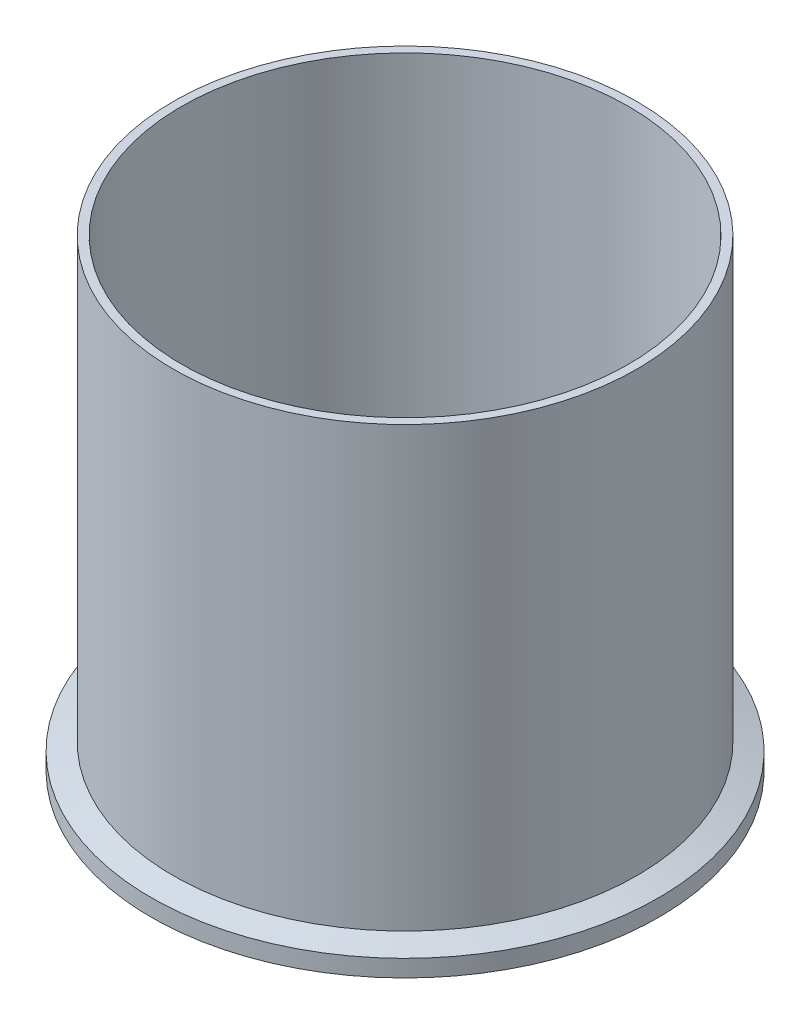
ISO-10303-21;
HEADER;
FILE_DESCRIPTION(('STEP AP214'),'2;1');
FILE_NAME('part.step','',(''),(''),'','','');
FILE_SCHEMA(('AUTOMOTIVE_DESIGN { 1 0 10303 214 1 1 1 1 }'));
ENDSEC;
DATA;
#1=APPLICATION_CONTEXT('core data for automotive mechanical design processes');
#2=APPLICATION_PROTOCOL_DEFINITION('international standard','automotive_design',2000,#1);
#3=PRODUCT_CONTEXT('',#1,'mechanical');
#4=PRODUCT('Part','Part','',(#3));
#5=PRODUCT_RELATED_PRODUCT_CATEGORY('part','',(#4));
#6=PRODUCT_DEFINITION_FORMATION('','',#4);
#7=PRODUCT_DEFINITION_CONTEXT('part definition',#1,'design');
#8=PRODUCT_DEFINITION('design','',#6,#7);
#9=PRODUCT_DEFINITION_SHAPE('','',#8);
#10=(LENGTH_UNIT() NAMED_UNIT(*) SI_UNIT(.MILLI.,.METRE.));
#11=(NAMED_UNIT(*) PLANE_ANGLE_UNIT() SI_UNIT($,.RADIAN.));
#12=(NAMED_UNIT(*) SI_UNIT($,.STERADIAN.) SOLID_ANGLE_UNIT());
#13=UNCERTAINTY_MEASURE_WITH_UNIT(LENGTH_MEASURE(1.E-05),#10,'distance_accuracy_value','');
#14=(GEOMETRIC_REPRESENTATION_CONTEXT(3) GLOBAL_UNCERTAINTY_ASSIGNED_CONTEXT((#13)) GLOBAL_UNIT_ASSIGNED_CONTEXT((#10,
#11,#12)) REPRESENTATION_CONTEXT('',''));
#15=CARTESIAN_POINT('',(0.,0.,0.));
#16=DIRECTION('',(0.,0.,1.));
#17=DIRECTION('',(1.,0.,0.));
#18=AXIS2_PLACEMENT_3D('',#15,#16,#17);
#19=CARTESIAN_POINT('',(0.,0.7874,0.));
#20=DIRECTION('',(0.,-1.,0.));
#21=DIRECTION('',(0.,0.,-1.));
#22=AXIS2_PLACEMENT_3D('',#19,#20,#21);
#23=TOROIDAL_SURFACE('',#22,79.9992084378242,0.787400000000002);
#24=CARTESIAN_POINT('',(0.,0.,0.));
#25=DIRECTION('',(0.,-1.,0.));
#26=DIRECTION('',(0.,0.,-1.));
#27=AXIS2_PLACEMENT_3D('',#24,#25,#26);
#28=CIRCLE('',#27,79.9992084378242);
#29=CARTESIAN_POINT('',(0.,0.,-79.9992084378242));
#30=VERTEX_POINT('',#29);
#31=EDGE_CURVE('E67',#30,#30,#28,.T.);
#32=ORIENTED_EDGE('',*,*,#31,.T.);
#33=EDGE_LOOP('',(#32));
#34=FACE_BOUND('',#33,.T.);
#35=CARTESIAN_POINT('',(0.,0.474458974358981,0.));
#36=DIRECTION('',(0.,-1.,0.));
#37=DIRECTION('',(0.,0.,-1.));
#38=AXIS2_PLACEMENT_3D('',#35,#36,#37);
#39=CIRCLE('',#38,79.2766666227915);
#40=CARTESIAN_POINT('',(0.,0.474458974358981,-79.2766666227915));
#41=VERTEX_POINT('',#40);
#42=EDGE_CURVE('E10',#41,#41,#39,.T.);
#43=ORIENTED_EDGE('',*,*,#42,.F.);
#44=EDGE_LOOP('',(#43));
#45=FACE_BOUND('',#44,.T.);
#46=ADVANCED_FACE('F33',(#34,#45),#23,.T.);
#47=CARTESIAN_POINT('',(0.,0.,0.));
#48=DIRECTION('',(0.,-1.,0.));
#49=DIRECTION('',(0.,0.,-1.));
#50=AXIS2_PLACEMENT_3D('',#47,#48,#49);
#51=TOROIDAL_SURFACE('',#50,78.1812,1.1938);
#52=CARTESIAN_POINT('',(0.,0.474458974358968,0.));
#53=DIRECTION('',(0.,-1.,0.));
#54=DIRECTION('',(0.,0.,-1.));
#55=AXIS2_PLACEMENT_3D('',#52,#53,#54);
#56=CIRCLE('',#55,77.0857333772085);
#57=CARTESIAN_POINT('',(0.,0.474458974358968,-77.0857333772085));
#58=VERTEX_POINT('',#57);
#59=EDGE_CURVE('E39',#58,#58,#56,.T.);
#60=ORIENTED_EDGE('',*,*,#59,.F.);
#61=EDGE_LOOP('',(#60));
#62=FACE_BOUND('',#61,.T.);
#63=ORIENTED_EDGE('',*,*,#42,.T.);
#64=EDGE_LOOP('',(#63));
#65=FACE_BOUND('',#64,.T.);
#66=ADVANCED_FACE('F115',(#62,#65),#51,.F.);
#67=CARTESIAN_POINT('',(0.,0.7874,0.));
#68=DIRECTION('',(0.,-1.,0.));
#69=DIRECTION('',(0.,0.,-1.));
#70=AXIS2_PLACEMENT_3D('',#67,#68,#69);
#71=TOROIDAL_SURFACE('',#70,76.3631915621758,0.787399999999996);
#72=ORIENTED_EDGE('',*,*,#59,.T.);
#73=EDGE_LOOP('',(#72));
#74=FACE_BOUND('',#73,.T.);
#75=CARTESIAN_POINT('',(0.,0.,0.));
#76=DIRECTION('',(0.,-1.,0.));
#77=DIRECTION('',(0.,0.,-1.));
#78=AXIS2_PLACEMENT_3D('',#75,#76,#77);
#79=CIRCLE('',#78,76.3631915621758);
#80=CARTESIAN_POINT('',(0.,0.,-76.3631915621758));
#81=VERTEX_POINT('',#80);
#82=EDGE_CURVE('E43',#81,#81,#79,.T.);
#83=ORIENTED_EDGE('',*,*,#82,.F.);
#84=EDGE_LOOP('',(#83));
#85=FACE_BOUND('',#84,.T.);
#86=ADVANCED_FACE('F111',(#74,#85),#71,.T.);
#87=CARTESIAN_POINT('',(0.,0.,0.));
#88=DIRECTION('',(0.,1.,0.));
#89=DIRECTION('',(0.,0.,1.));
#90=AXIS2_PLACEMENT_3D('',#87,#88,#89);
#91=PLANE('',#90);
#92=CARTESIAN_POINT('',(0.,0.,0.));
#93=DIRECTION('',(0.,-1.,0.));
#94=DIRECTION('',(0.,0.,-1.));
#95=AXIS2_PLACEMENT_3D('',#92,#93,#94);
#96=CIRCLE('',#95,73.4314);
#97=CARTESIAN_POINT('',(0.,0.,-73.4314));
#98=VERTEX_POINT('',#97);
#99=EDGE_CURVE('E47',#98,#98,#96,.T.);
#100=ORIENTED_EDGE('',*,*,#99,.F.);
#101=EDGE_LOOP('',(#100));
#102=FACE_BOUND('',#101,.T.);
#103=ORIENTED_EDGE('',*,*,#82,.T.);
#104=EDGE_LOOP('',(#103));
#105=FACE_BOUND('',#104,.T.);
#106=ADVANCED_FACE('F105',(#102,#105),#91,.F.);
#107=CARTESIAN_POINT('',(0.,0.,0.));
#108=DIRECTION('',(0.,-1.,0.));
#109=DIRECTION('',(0.,0.,-1.));
#110=AXIS2_PLACEMENT_3D('',#107,#108,#109);
#111=CYLINDRICAL_SURFACE('',#110,73.4314);
#112=ORIENTED_EDGE('',*,*,#99,.T.);
#113=EDGE_LOOP('',(#112));
#114=FACE_BOUND('',#113,.T.);
#115=CARTESIAN_POINT('',(0.,152.4,0.));
#116=DIRECTION('',(0.,-1.,0.));
#117=DIRECTION('',(0.,0.,-1.));
#118=AXIS2_PLACEMENT_3D('',#115,#116,#117);
#119=CIRCLE('',#118,73.4314);
#120=CARTESIAN_POINT('',(0.,152.4,-73.4314));
#121=VERTEX_POINT('',#120);
#122=EDGE_CURVE('E52',#121,#121,#119,.T.);
#123=ORIENTED_EDGE('',*,*,#122,.F.);
#124=EDGE_LOOP('',(#123));
#125=FACE_BOUND('',#124,.T.);
#126=ADVANCED_FACE('F100',(#114,#125),#111,.F.);
#127=CARTESIAN_POINT('',(0.,152.4,0.));
#128=DIRECTION('',(0.,-1.,0.));
#129=DIRECTION('',(0.,0.,-1.));
#130=AXIS2_PLACEMENT_3D('',#127,#128,#129);
#131=PLANE('',#130);
#132=CARTESIAN_POINT('',(0.,152.4,0.));
#133=DIRECTION('',(0.,-1.,0.));
#134=DIRECTION('',(0.,0.,-1.));
#135=AXIS2_PLACEMENT_3D('',#132,#133,#134);
#136=CIRCLE('',#135,76.2);
#137=CARTESIAN_POINT('',(0.,152.4,-76.2));
#138=VERTEX_POINT('',#137);
#139=EDGE_CURVE('E55',#138,#138,#136,.T.);
#140=ORIENTED_EDGE('',*,*,#139,.F.);
#141=EDGE_LOOP('',(#140));
#142=FACE_BOUND('',#141,.T.);
#143=ORIENTED_EDGE('',*,*,#122,.T.);
#144=EDGE_LOOP('',(#143));
#145=FACE_BOUND('',#144,.T.);
#146=ADVANCED_FACE('F94',(#142,#145),#131,.F.);
#147=CARTESIAN_POINT('',(0.,0.,0.));
#148=DIRECTION('',(0.,-1.,0.));
#149=DIRECTION('',(0.,0.,-1.));
#150=AXIS2_PLACEMENT_3D('',#147,#148,#149);
#151=CYLINDRICAL_SURFACE('',#150,76.2);
#152=CARTESIAN_POINT('',(0.,8.22278052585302,0.));
#153=DIRECTION('',(0.,-1.,0.));
#154=DIRECTION('',(0.,0.,-1.));
#155=AXIS2_PLACEMENT_3D('',#152,#153,#154);
#156=CIRCLE('',#155,76.2);
#157=CARTESIAN_POINT('',(0.,8.22278052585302,-76.2));
#158=VERTEX_POINT('',#157);
#159=EDGE_CURVE('E58',#158,#158,#156,.T.);
#160=ORIENTED_EDGE('',*,*,#159,.F.);
#161=EDGE_LOOP('',(#160));
#162=FACE_BOUND('',#161,.T.);
#163=ORIENTED_EDGE('',*,*,#139,.T.);
#164=EDGE_LOOP('',(#163));
#165=FACE_BOUND('',#164,.T.);
#166=ADVANCED_FACE('F88',(#162,#165),#151,.T.);
#167=CARTESIAN_POINT('',(0.,8.22278052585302,0.));
#168=DIRECTION('',(0.,-1.,0.));
#169=DIRECTION('',(0.,0.,-1.));
#170=AXIS2_PLACEMENT_3D('',#167,#168,#169);
#171=CONICAL_SURFACE('',#170,76.2,1.22173047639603);
#172=CARTESIAN_POINT('',(0.,5.588,0.));
#173=DIRECTION('',(0.,-1.,0.));
#174=DIRECTION('',(0.,0.,-1.));
#175=AXIS2_PLACEMENT_3D('',#172,#173,#174);
#176=CIRCLE('',#175,83.439);
#177=CARTESIAN_POINT('',(0.,5.588,-83.439));
#178=VERTEX_POINT('',#177);
#179=EDGE_CURVE('E61',#178,#178,#176,.T.);
#180=ORIENTED_EDGE('',*,*,#179,.F.);
#181=EDGE_LOOP('',(#180));
#182=FACE_BOUND('',#181,.T.);
#183=ORIENTED_EDGE('',*,*,#159,.T.);
#184=EDGE_LOOP('',(#183));
#185=FACE_BOUND('',#184,.T.);
#186=ADVANCED_FACE('F82',(#182,#185),#171,.T.);
#187=CARTESIAN_POINT('',(0.,0.,0.));
#188=DIRECTION('',(0.,-1.,0.));
#189=DIRECTION('',(0.,0.,-1.));
#190=AXIS2_PLACEMENT_3D('',#187,#188,#189);
#191=CYLINDRICAL_SURFACE('',#190,83.439);
#192=CARTESIAN_POINT('',(0.,0.,0.));
#193=DIRECTION('',(0.,-1.,0.));
#194=DIRECTION('',(0.,0.,-1.));
#195=AXIS2_PLACEMENT_3D('',#192,#193,#194);
#196=CIRCLE('',#195,83.439);
#197=CARTESIAN_POINT('',(0.,0.,-83.439));
#198=VERTEX_POINT('',#197);
#199=EDGE_CURVE('E64',#198,#198,#196,.T.);
#200=ORIENTED_EDGE('',*,*,#199,.F.);
#201=EDGE_LOOP('',(#200));
#202=FACE_BOUND('',#201,.T.);
#203=ORIENTED_EDGE('',*,*,#179,.T.);
#204=EDGE_LOOP('',(#203));
#205=FACE_BOUND('',#204,.T.);
#206=ADVANCED_FACE('F76',(#202,#205),#191,.T.);
#207=CARTESIAN_POINT('',(0.,0.,0.));
#208=DIRECTION('',(0.,1.,0.));
#209=DIRECTION('',(0.,0.,1.));
#210=AXIS2_PLACEMENT_3D('',#207,#208,#209);
#211=PLANE('',#210);
#212=ORIENTED_EDGE('',*,*,#31,.F.);
#213=EDGE_LOOP('',(#212));
#214=FACE_BOUND('',#213,.T.);
#215=ORIENTED_EDGE('',*,*,#199,.T.);
#216=EDGE_LOOP('',(#215));
#217=FACE_BOUND('',#216,.T.);
#218=ADVANCED_FACE('F73',(#214,#217),#211,.F.);
#219=CLOSED_SHELL('',(#46,#66,#86,#106,#126,#146,#166,#186,#206,#218));
#220=MANIFOLD_SOLID_BREP('B2',#219);
#221=ADVANCED_BREP_SHAPE_REPRESENTATION('',(#18,#220),#14);
#222=SHAPE_DEFINITION_REPRESENTATION(#9,#221);
ENDSEC;
END-ISO-10303-21;
